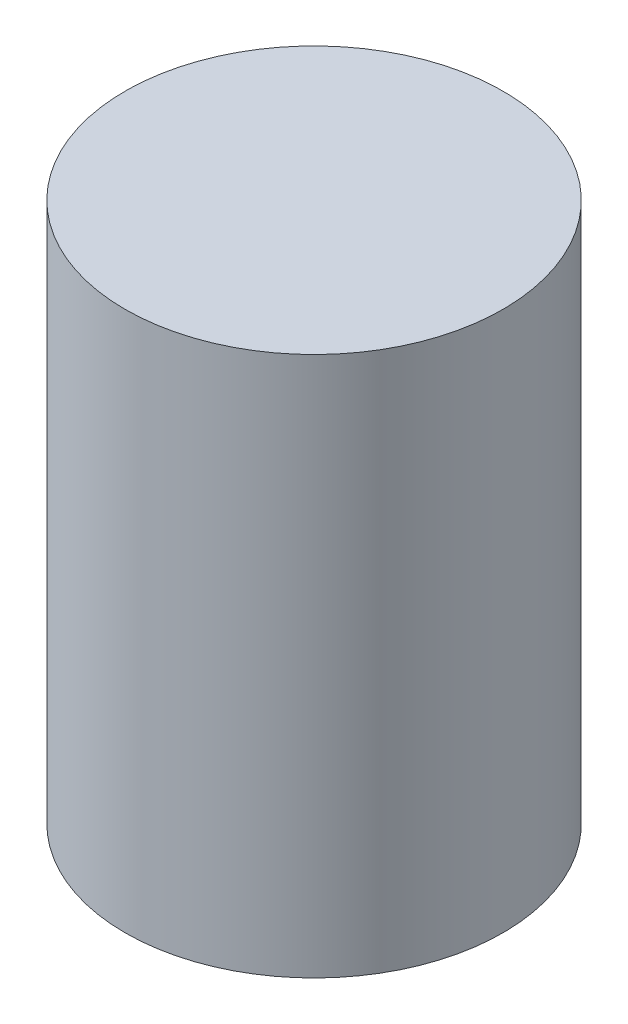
from build123d import *

# Parameters (mm, degrees)
SKETCH_1_R      = 49
SKETCH_1_R_2    = 35
EXTRUDE_1_DEPTH = 140
SKETCH_1_2_R    = 35
EXTRUDE_2_DEPTH = 30
EXTRUDE_START   = 110
SKETCH_1_3_R    = 35
EXTRUDE_3_DEPTH = 30


with BuildPart() as part:
    # Sketch 1 → Extrude 1 (new body)
    with BuildSketch(Plane(origin=(0, 0, 0), x_dir=(1, 0, 0), z_dir=(0, 1, 0))):
        with Locations(Location((0, 0, 0), (0, 0, 270))):
            Circle(SKETCH_1_R)
        with Locations(Location((0, 0, 0), (0, 0, 270))):
            Circle(SKETCH_1_R_2, mode=Mode.SUBTRACT)
    extrude(amount=EXTRUDE_1_DEPTH)

    # Sketch 1_2 → Extrude 2 (add)
    with BuildSketch(Plane(origin=(0, 0, 0), x_dir=(1, 0, 0), z_dir=(0, 1, 0))):
        with Locations(Location((0, 0, 0), (0, 0, 270))):
            Circle(SKETCH_1_2_R)
    extrude(amount=EXTRUDE_2_DEPTH)

    # Sketch 1_3 → Extrude 3 (add)
    with BuildSketch(Plane(origin=(0, 0, 0), x_dir=(1, 0, 0), z_dir=(0, 1, 0)).offset(EXTRUDE_START)):
        with Locations(Location((0, 0, 0), (0, 0, 270))):
            Circle(SKETCH_1_3_R)
    extrude(amount=EXTRUDE_3_DEPTH)


solid = part.part
